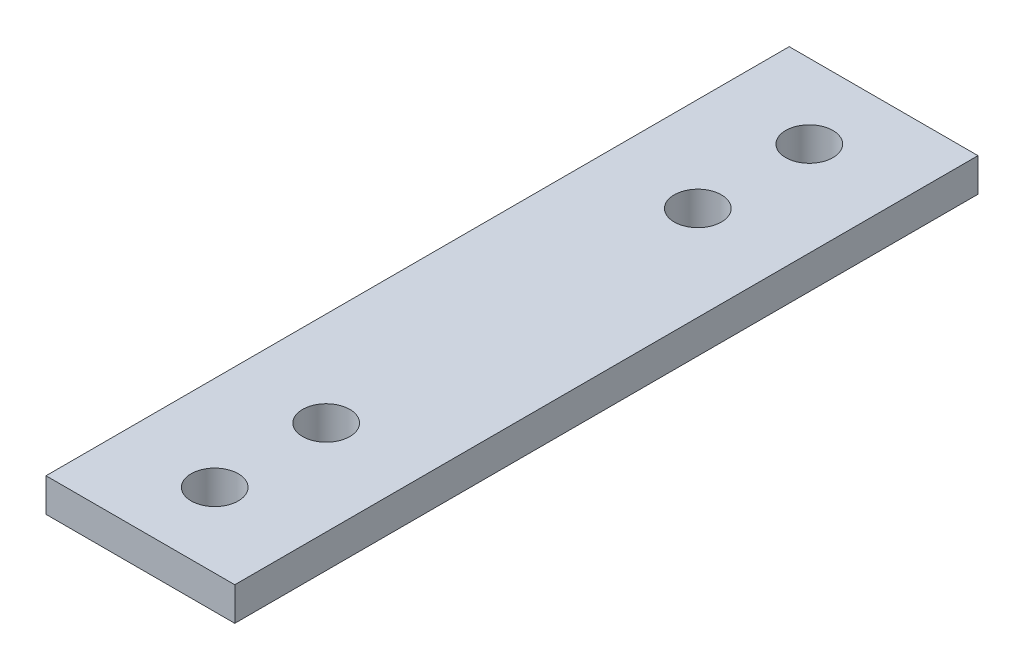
ISO-10303-21;
HEADER;
FILE_DESCRIPTION(('STEP AP214'),'2;1');
FILE_NAME('part.step','',(''),(''),'','','');
FILE_SCHEMA(('AUTOMOTIVE_DESIGN { 1 0 10303 214 1 1 1 1 }'));
ENDSEC;
DATA;
#1=APPLICATION_CONTEXT('core data for automotive mechanical design processes');
#2=APPLICATION_PROTOCOL_DEFINITION('international standard','automotive_design',2000,#1);
#3=PRODUCT_CONTEXT('',#1,'mechanical');
#4=PRODUCT('Part','Part','',(#3));
#5=PRODUCT_RELATED_PRODUCT_CATEGORY('part','',(#4));
#6=PRODUCT_DEFINITION_FORMATION('','',#4);
#7=PRODUCT_DEFINITION_CONTEXT('part definition',#1,'design');
#8=PRODUCT_DEFINITION('design','',#6,#7);
#9=PRODUCT_DEFINITION_SHAPE('','',#8);
#10=(LENGTH_UNIT() NAMED_UNIT(*) SI_UNIT(.MILLI.,.METRE.));
#11=(NAMED_UNIT(*) PLANE_ANGLE_UNIT() SI_UNIT($,.RADIAN.));
#12=(NAMED_UNIT(*) SI_UNIT($,.STERADIAN.) SOLID_ANGLE_UNIT());
#13=UNCERTAINTY_MEASURE_WITH_UNIT(LENGTH_MEASURE(1.E-05),#10,'distance_accuracy_value','');
#14=(GEOMETRIC_REPRESENTATION_CONTEXT(3) GLOBAL_UNCERTAINTY_ASSIGNED_CONTEXT((#13)) GLOBAL_UNIT_ASSIGNED_CONTEXT((#10,
#11,#12)) REPRESENTATION_CONTEXT('',''));
#15=CARTESIAN_POINT('',(0.,0.,0.));
#16=DIRECTION('',(0.,0.,1.));
#17=DIRECTION('',(1.,0.,0.));
#18=AXIS2_PLACEMENT_3D('',#15,#16,#17);
#19=CARTESIAN_POINT('',(-12.7,4.5,0.));
#20=DIRECTION('',(1.,0.,0.));
#21=DIRECTION('',(0.,0.,-1.));
#22=AXIS2_PLACEMENT_3D('',#19,#20,#21);
#23=PLANE('',#22);
#24=DIRECTION('',(0.,0.,1.));
#25=VECTOR('',#24,1.);
#26=CARTESIAN_POINT('',(-12.7,0.,0.));
#27=LINE('',#26,#25);
#28=CARTESIAN_POINT('',(-12.7,0.,0.));
#29=VERTEX_POINT('',#28);
#30=CARTESIAN_POINT('',(-12.7,0.,100.));
#31=VERTEX_POINT('',#30);
#32=EDGE_CURVE('E70',#29,#31,#27,.T.);
#33=ORIENTED_EDGE('',*,*,#32,.T.);
#34=DIRECTION('',(0.,-1.,0.));
#35=VECTOR('',#34,1.);
#36=CARTESIAN_POINT('',(-12.7,4.5,100.));
#37=LINE('',#36,#35);
#38=CARTESIAN_POINT('',(-12.7,4.5,100.));
#39=VERTEX_POINT('',#38);
#40=EDGE_CURVE('E11',#39,#31,#37,.T.);
#41=ORIENTED_EDGE('',*,*,#40,.F.);
#42=DIRECTION('',(0.,0.,1.));
#43=VECTOR('',#42,1.);
#44=CARTESIAN_POINT('',(-12.7,4.5,0.));
#45=LINE('',#44,#43);
#46=CARTESIAN_POINT('',(-12.7,4.5,0.));
#47=VERTEX_POINT('',#46);
#48=EDGE_CURVE('E93',#47,#39,#45,.T.);
#49=ORIENTED_EDGE('',*,*,#48,.F.);
#50=DIRECTION('',(0.,-1.,0.));
#51=VECTOR('',#50,1.);
#52=CARTESIAN_POINT('',(-12.7,4.5,0.));
#53=LINE('',#52,#51);
#54=EDGE_CURVE('E82',#47,#29,#53,.T.);
#55=ORIENTED_EDGE('',*,*,#54,.T.);
#56=EDGE_LOOP('',(#33,#41,#49,#55));
#57=FACE_BOUND('',#56,.T.);
#58=ADVANCED_FACE('F26',(#57),#23,.F.);
#59=CARTESIAN_POINT('',(-12.7,4.5,100.));
#60=DIRECTION('',(0.,0.,-1.));
#61=DIRECTION('',(-1.,0.,0.));
#62=AXIS2_PLACEMENT_3D('',#59,#60,#61);
#63=PLANE('',#62);
#64=DIRECTION('',(1.,0.,0.));
#65=VECTOR('',#64,1.);
#66=CARTESIAN_POINT('',(-12.7,0.,100.));
#67=LINE('',#66,#65);
#68=CARTESIAN_POINT('',(12.7,0.,100.));
#69=VERTEX_POINT('',#68);
#70=EDGE_CURVE('E66',#31,#69,#67,.T.);
#71=ORIENTED_EDGE('',*,*,#70,.T.);
#72=DIRECTION('',(0.,-1.,0.));
#73=VECTOR('',#72,1.);
#74=CARTESIAN_POINT('',(12.7,4.5,100.));
#75=LINE('',#74,#73);
#76=CARTESIAN_POINT('',(12.7,4.5,100.));
#77=VERTEX_POINT('',#76);
#78=EDGE_CURVE('E33',#77,#69,#75,.T.);
#79=ORIENTED_EDGE('',*,*,#78,.F.);
#80=DIRECTION('',(1.,0.,0.));
#81=VECTOR('',#80,1.);
#82=CARTESIAN_POINT('',(-12.7,4.5,100.));
#83=LINE('',#82,#81);
#84=EDGE_CURVE('E78',#39,#77,#83,.T.);
#85=ORIENTED_EDGE('',*,*,#84,.F.);
#86=ORIENTED_EDGE('',*,*,#40,.T.);
#87=EDGE_LOOP('',(#71,#79,#85,#86));
#88=FACE_BOUND('',#87,.T.);
#89=ADVANCED_FACE('F77',(#88),#63,.F.);
#90=CARTESIAN_POINT('',(12.7,4.5,0.));
#91=DIRECTION('',(-1.,0.,0.));
#92=DIRECTION('',(0.,0.,1.));
#93=AXIS2_PLACEMENT_3D('',#90,#91,#92);
#94=PLANE('',#93);
#95=DIRECTION('',(0.,0.,-1.));
#96=VECTOR('',#95,1.);
#97=CARTESIAN_POINT('',(12.7,0.,0.));
#98=LINE('',#97,#96);
#99=CARTESIAN_POINT('',(12.7,0.,0.));
#100=VERTEX_POINT('',#99);
#101=EDGE_CURVE('E71',#69,#100,#98,.T.);
#102=ORIENTED_EDGE('',*,*,#101,.T.);
#103=DIRECTION('',(0.,-1.,0.));
#104=VECTOR('',#103,1.);
#105=CARTESIAN_POINT('',(12.7,4.5,0.));
#106=LINE('',#105,#104);
#107=CARTESIAN_POINT('',(12.7,4.5,0.));
#108=VERTEX_POINT('',#107);
#109=EDGE_CURVE('E99',#108,#100,#106,.T.);
#110=ORIENTED_EDGE('',*,*,#109,.F.);
#111=DIRECTION('',(0.,0.,-1.));
#112=VECTOR('',#111,1.);
#113=CARTESIAN_POINT('',(12.7,4.5,0.));
#114=LINE('',#113,#112);
#115=EDGE_CURVE('E45',#77,#108,#114,.T.);
#116=ORIENTED_EDGE('',*,*,#115,.F.);
#117=ORIENTED_EDGE('',*,*,#78,.T.);
#118=EDGE_LOOP('',(#102,#110,#116,#117));
#119=FACE_BOUND('',#118,.T.);
#120=ADVANCED_FACE('F102',(#119),#94,.F.);
#121=CARTESIAN_POINT('',(-12.7,4.5,0.));
#122=DIRECTION('',(0.,0.,1.));
#123=DIRECTION('',(1.,0.,0.));
#124=AXIS2_PLACEMENT_3D('',#121,#122,#123);
#125=PLANE('',#124);
#126=DIRECTION('',(-1.,0.,0.));
#127=VECTOR('',#126,1.);
#128=CARTESIAN_POINT('',(-12.7,0.,0.));
#129=LINE('',#128,#127);
#130=EDGE_CURVE('E91',#100,#29,#129,.T.);
#131=ORIENTED_EDGE('',*,*,#130,.T.);
#132=ORIENTED_EDGE('',*,*,#54,.F.);
#133=DIRECTION('',(-1.,0.,0.));
#134=VECTOR('',#133,1.);
#135=CARTESIAN_POINT('',(-12.7,4.5,0.));
#136=LINE('',#135,#134);
#137=EDGE_CURVE('E40',#108,#47,#136,.T.);
#138=ORIENTED_EDGE('',*,*,#137,.F.);
#139=ORIENTED_EDGE('',*,*,#109,.T.);
#140=EDGE_LOOP('',(#131,#132,#138,#139));
#141=FACE_BOUND('',#140,.T.);
#142=ADVANCED_FACE('F104',(#141),#125,.F.);
#143=CARTESIAN_POINT('',(-12.7,4.5,100.));
#144=DIRECTION('',(0.,1.,0.));
#145=DIRECTION('',(0.,0.,1.));
#146=AXIS2_PLACEMENT_3D('',#143,#144,#145);
#147=PLANE('',#146);
#148=CARTESIAN_POINT('',(0.,4.5,10.));
#149=DIRECTION('',(0.,1.,0.));
#150=DIRECTION('',(0.,0.,1.));
#151=AXIS2_PLACEMENT_3D('',#148,#149,#150);
#152=CIRCLE('',#151,3.175);
#153=CARTESIAN_POINT('',(0.,4.5,13.175));
#154=VERTEX_POINT('',#153);
#155=EDGE_CURVE('E174',#154,#154,#152,.T.);
#156=ORIENTED_EDGE('',*,*,#155,.F.);
#157=EDGE_LOOP('',(#156));
#158=FACE_BOUND('',#157,.T.);
#159=CARTESIAN_POINT('',(0.,4.5,25.));
#160=DIRECTION('',(0.,1.,0.));
#161=DIRECTION('',(0.,0.,1.));
#162=AXIS2_PLACEMENT_3D('',#159,#160,#161);
#163=CIRCLE('',#162,3.175);
#164=CARTESIAN_POINT('',(0.,4.5,28.175));
#165=VERTEX_POINT('',#164);
#166=EDGE_CURVE('E178',#165,#165,#163,.T.);
#167=ORIENTED_EDGE('',*,*,#166,.F.);
#168=EDGE_LOOP('',(#167));
#169=FACE_BOUND('',#168,.T.);
#170=CARTESIAN_POINT('',(0.,4.5,75.));
#171=DIRECTION('',(0.,1.,0.));
#172=DIRECTION('',(0.,0.,1.));
#173=AXIS2_PLACEMENT_3D('',#170,#171,#172);
#174=CIRCLE('',#173,3.175);
#175=CARTESIAN_POINT('',(0.,4.5,78.175));
#176=VERTEX_POINT('',#175);
#177=EDGE_CURVE('E187',#176,#176,#174,.T.);
#178=ORIENTED_EDGE('',*,*,#177,.F.);
#179=EDGE_LOOP('',(#178));
#180=FACE_BOUND('',#179,.T.);
#181=CARTESIAN_POINT('',(0.,4.5,90.));
#182=DIRECTION('',(0.,1.,0.));
#183=DIRECTION('',(0.,0.,1.));
#184=AXIS2_PLACEMENT_3D('',#181,#182,#183);
#185=CIRCLE('',#184,3.175);
#186=CARTESIAN_POINT('',(0.,4.5,93.175));
#187=VERTEX_POINT('',#186);
#188=EDGE_CURVE('E86',#187,#187,#185,.T.);
#189=ORIENTED_EDGE('',*,*,#188,.F.);
#190=EDGE_LOOP('',(#189));
#191=FACE_BOUND('',#190,.T.);
#192=ORIENTED_EDGE('',*,*,#48,.T.);
#193=ORIENTED_EDGE('',*,*,#84,.T.);
#194=ORIENTED_EDGE('',*,*,#115,.T.);
#195=ORIENTED_EDGE('',*,*,#137,.T.);
#196=EDGE_LOOP('',(#192,#193,#194,#195));
#197=FACE_BOUND('',#196,.T.);
#198=ADVANCED_FACE('F105',(#158,#169,#180,#191,#197),#147,.T.);
#199=CARTESIAN_POINT('',(-12.7,0.,100.));
#200=DIRECTION('',(0.,1.,0.));
#201=DIRECTION('',(0.,0.,1.));
#202=AXIS2_PLACEMENT_3D('',#199,#200,#201);
#203=PLANE('',#202);
#204=CARTESIAN_POINT('',(0.,0.,10.));
#205=DIRECTION('',(0.,1.,0.));
#206=DIRECTION('',(0.,0.,1.));
#207=AXIS2_PLACEMENT_3D('',#204,#205,#206);
#208=CIRCLE('',#207,3.175);
#209=CARTESIAN_POINT('',(0.,0.,13.175));
#210=VERTEX_POINT('',#209);
#211=EDGE_CURVE('E177',#210,#210,#208,.F.);
#212=ORIENTED_EDGE('',*,*,#211,.F.);
#213=EDGE_LOOP('',(#212));
#214=FACE_BOUND('',#213,.T.);
#215=CARTESIAN_POINT('',(0.,0.,25.));
#216=DIRECTION('',(0.,1.,0.));
#217=DIRECTION('',(0.,0.,1.));
#218=AXIS2_PLACEMENT_3D('',#215,#216,#217);
#219=CIRCLE('',#218,3.175);
#220=CARTESIAN_POINT('',(0.,0.,28.175));
#221=VERTEX_POINT('',#220);
#222=EDGE_CURVE('E181',#221,#221,#219,.F.);
#223=ORIENTED_EDGE('',*,*,#222,.F.);
#224=EDGE_LOOP('',(#223));
#225=FACE_BOUND('',#224,.T.);
#226=CARTESIAN_POINT('',(0.,0.,75.));
#227=DIRECTION('',(0.,1.,0.));
#228=DIRECTION('',(0.,0.,1.));
#229=AXIS2_PLACEMENT_3D('',#226,#227,#228);
#230=CIRCLE('',#229,3.175);
#231=CARTESIAN_POINT('',(0.,0.,78.175));
#232=VERTEX_POINT('',#231);
#233=EDGE_CURVE('E190',#232,#232,#230,.F.);
#234=ORIENTED_EDGE('',*,*,#233,.F.);
#235=EDGE_LOOP('',(#234));
#236=FACE_BOUND('',#235,.T.);
#237=CARTESIAN_POINT('',(0.,0.,90.));
#238=DIRECTION('',(0.,1.,0.));
#239=DIRECTION('',(0.,0.,1.));
#240=AXIS2_PLACEMENT_3D('',#237,#238,#239);
#241=CIRCLE('',#240,3.175);
#242=CARTESIAN_POINT('',(0.,0.,93.175));
#243=VERTEX_POINT('',#242);
#244=EDGE_CURVE('E83',#243,#243,#241,.F.);
#245=ORIENTED_EDGE('',*,*,#244,.F.);
#246=EDGE_LOOP('',(#245));
#247=FACE_BOUND('',#246,.T.);
#248=ORIENTED_EDGE('',*,*,#32,.F.);
#249=ORIENTED_EDGE('',*,*,#130,.F.);
#250=ORIENTED_EDGE('',*,*,#101,.F.);
#251=ORIENTED_EDGE('',*,*,#70,.F.);
#252=EDGE_LOOP('',(#248,#249,#250,#251));
#253=FACE_BOUND('',#252,.T.);
#254=ADVANCED_FACE('F67',(#214,#225,#236,#247,#253),#203,.F.);
#255=CARTESIAN_POINT('',(0.,-0.00100000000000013,90.));
#256=DIRECTION('',(0.,1.,0.));
#257=DIRECTION('',(0.,0.,1.));
#258=AXIS2_PLACEMENT_3D('',#255,#256,#257);
#259=CYLINDRICAL_SURFACE('',#258,3.175);
#260=ORIENTED_EDGE('',*,*,#188,.T.);
#261=EDGE_LOOP('',(#260));
#262=FACE_BOUND('',#261,.T.);
#263=ORIENTED_EDGE('',*,*,#244,.T.);
#264=EDGE_LOOP('',(#263));
#265=FACE_BOUND('',#264,.T.);
#266=ADVANCED_FACE('F113',(#262,#265),#259,.F.);
#267=CARTESIAN_POINT('',(0.,-0.00100000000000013,75.));
#268=DIRECTION('',(0.,1.,0.));
#269=DIRECTION('',(0.,0.,1.));
#270=AXIS2_PLACEMENT_3D('',#267,#268,#269);
#271=CYLINDRICAL_SURFACE('',#270,3.175);
#272=ORIENTED_EDGE('',*,*,#177,.T.);
#273=EDGE_LOOP('',(#272));
#274=FACE_BOUND('',#273,.T.);
#275=ORIENTED_EDGE('',*,*,#233,.T.);
#276=EDGE_LOOP('',(#275));
#277=FACE_BOUND('',#276,.T.);
#278=ADVANCED_FACE('F146',(#274,#277),#271,.F.);
#279=CARTESIAN_POINT('',(0.,-0.00100000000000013,25.));
#280=DIRECTION('',(0.,1.,0.));
#281=DIRECTION('',(0.,0.,1.));
#282=AXIS2_PLACEMENT_3D('',#279,#280,#281);
#283=CYLINDRICAL_SURFACE('',#282,3.175);
#284=ORIENTED_EDGE('',*,*,#166,.T.);
#285=EDGE_LOOP('',(#284));
#286=FACE_BOUND('',#285,.T.);
#287=ORIENTED_EDGE('',*,*,#222,.T.);
#288=EDGE_LOOP('',(#287));
#289=FACE_BOUND('',#288,.T.);
#290=ADVANCED_FACE('F154',(#286,#289),#283,.F.);
#291=CARTESIAN_POINT('',(0.,-0.00100000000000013,10.));
#292=DIRECTION('',(0.,1.,0.));
#293=DIRECTION('',(0.,0.,1.));
#294=AXIS2_PLACEMENT_3D('',#291,#292,#293);
#295=CYLINDRICAL_SURFACE('',#294,3.175);
#296=ORIENTED_EDGE('',*,*,#155,.T.);
#297=EDGE_LOOP('',(#296));
#298=FACE_BOUND('',#297,.T.);
#299=ORIENTED_EDGE('',*,*,#211,.T.);
#300=EDGE_LOOP('',(#299));
#301=FACE_BOUND('',#300,.T.);
#302=ADVANCED_FACE('F162',(#298,#301),#295,.F.);
#303=CLOSED_SHELL('',(#58,#89,#120,#142,#198,#254,#266,#278,#290,#302));
#304=MANIFOLD_SOLID_BREP('B2',#303);
#305=ADVANCED_BREP_SHAPE_REPRESENTATION('',(#18,#304),#14);
#306=SHAPE_DEFINITION_REPRESENTATION(#9,#305);
ENDSEC;
END-ISO-10303-21;
